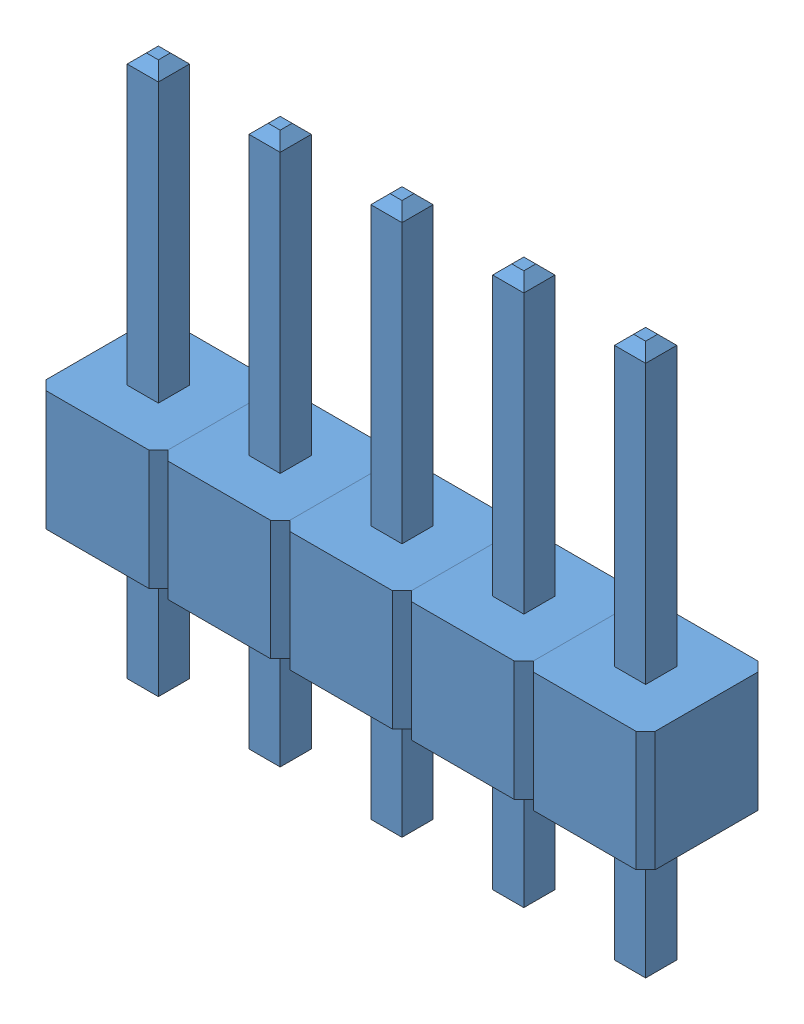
SolidWorks assembly Header5.SLDASM, configuration Default (file format 9000). Lengths in mm.
Overall size (12.7 11.5 2.54).
5 component instances, 1 part files, 12 mates.
Components (placement in the parent):
- Header-1: Header.SLDPRT [Default] at (1.8213 3.3514 10.0633) size (2.54 11.5 2.54)
- Header-2: Header.SLDPRT [Default] at (4.3613 3.3514 10.0633) size (2.54 11.5 2.54)
- Header-3: Header.SLDPRT [Default] at (6.9013 3.3514 10.0633) size (2.54 11.5 2.54)
- Header-4: Header.SLDPRT [Default] at (-0.7187 3.3514 10.0633) size (2.54 11.5 2.54)
- Header-5: Header.SLDPRT [Default] at (-3.2587 3.3514 10.0633) size (2.54 11.5 2.54)
Mates (geometry in assembly coordinates):
- Coincident1: coincident: plane of Header-1 through (3.0913 5.8514 11.3333) normal (1 0 0); plane of Header-2 through (3.0913 5.8514 11.3333) normal (-1 0 0)
- Coincident2: coincident: plane of Header-1 through (0.5513 5.8514 11.3333) normal (0 0 1); plane of Header-2 through (3.0913 5.8514 11.3333) normal (0 0 1)
- Coincident3: coincident aligned: plane of Header-1 through (1.8213 5.8514 10.0633) normal (0 1 0); plane of Header-2 through (4.3613 5.8514 10.0633) normal (0 1 0)
- Coincident4: coincident: plane of Header-2 through (4.3613 5.8514 10.0633) normal (0 1 0); plane of Header-3 through (6.9013 5.8514 10.0633) normal (0 1 0)
- Coincident5: coincident: plane of Header-2 through (3.0913 5.8514 11.3333) normal (0 0 1); plane of Header-3 through (5.6313 5.8514 11.3333) normal (0 0 1)
- Coincident6: coincident anti-aligned: plane of Header-2 through (5.6313 5.8514 11.3333) normal (1 0 0); plane of Header-3 through (5.6313 5.8514 11.3333) normal (-1 0 0)
- Coincident7: coincident: plane of Header-1 through (1.8213 5.8514 10.0633) normal (0 1 0); plane of Header-4 through (-0.7187 5.8514 10.0633) normal (0 1 0)
- Coincident8: coincident: plane of Header-1 through (0.5513 5.8514 11.3333) normal (0 0 1); plane of Header-4 through (-1.9887 5.8514 11.3333) normal (0 0 1)
- Coincident9: coincident anti-aligned: plane of Header-1 through (0.5513 5.8514 11.3333) normal (-1 0 0); plane of Header-4 through (0.5513 5.8514 11.3333) normal (1 0 0)
- Coincident10: coincident: plane of Header-4 through (-1.9887 5.8514 11.3333) normal (-1 0 0); plane of Header-5 through (-1.9887 5.8514 11.3333) normal (1 0 0)
- Coincident11: coincident: plane of Header-4 through (-1.9887 5.8514 11.3333) normal (0 0 1); plane of Header-5 through (-4.5287 5.8514 11.3333) normal (0 0 1)
- Coincident12: coincident aligned: plane of Header-4 through (-0.7187 5.8514 10.0633) normal (0 1 0); plane of Header-5 through (-3.2587 5.8514 10.0633) normal (0 1 0)
